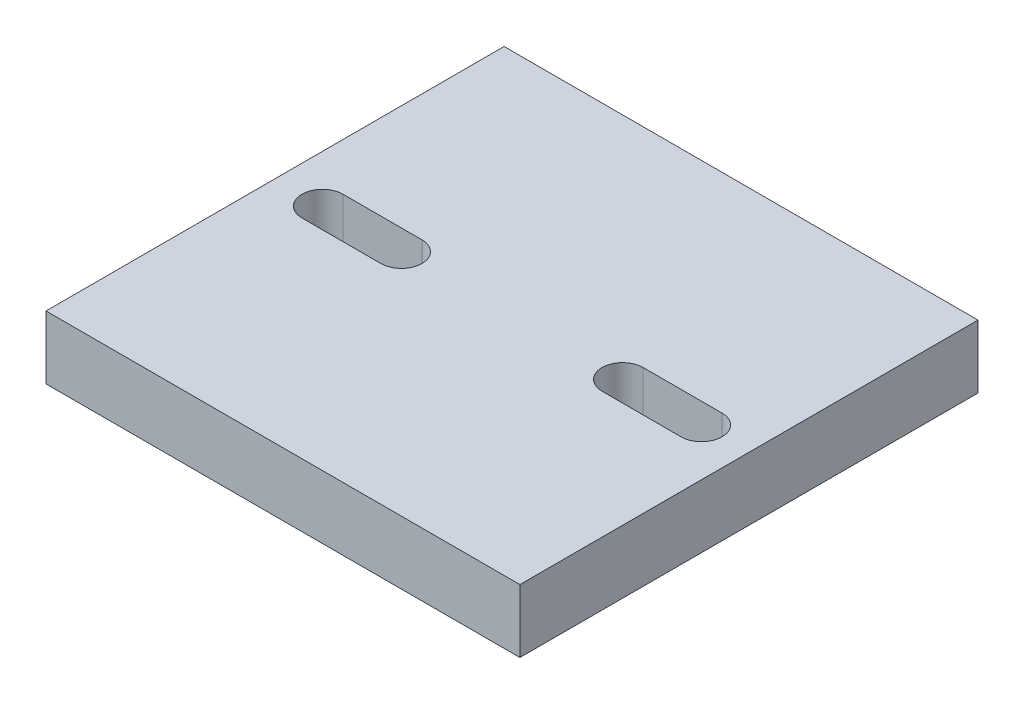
ISO-10303-21;
HEADER;
FILE_DESCRIPTION(('STEP AP214'),'2;1');
FILE_NAME('part.step','',(''),(''),'','','');
FILE_SCHEMA(('AUTOMOTIVE_DESIGN { 1 0 10303 214 1 1 1 1 }'));
ENDSEC;
DATA;
#1=APPLICATION_CONTEXT('core data for automotive mechanical design processes');
#2=APPLICATION_PROTOCOL_DEFINITION('international standard','automotive_design',2000,#1);
#3=PRODUCT_CONTEXT('',#1,'mechanical');
#4=PRODUCT('Part','Part','',(#3));
#5=PRODUCT_RELATED_PRODUCT_CATEGORY('part','',(#4));
#6=PRODUCT_DEFINITION_FORMATION('','',#4);
#7=PRODUCT_DEFINITION_CONTEXT('part definition',#1,'design');
#8=PRODUCT_DEFINITION('design','',#6,#7);
#9=PRODUCT_DEFINITION_SHAPE('','',#8);
#10=(LENGTH_UNIT() NAMED_UNIT(*) SI_UNIT(.MILLI.,.METRE.));
#11=(NAMED_UNIT(*) PLANE_ANGLE_UNIT() SI_UNIT($,.RADIAN.));
#12=(NAMED_UNIT(*) SI_UNIT($,.STERADIAN.) SOLID_ANGLE_UNIT());
#13=UNCERTAINTY_MEASURE_WITH_UNIT(LENGTH_MEASURE(1.E-05),#10,'distance_accuracy_value','');
#14=(GEOMETRIC_REPRESENTATION_CONTEXT(3) GLOBAL_UNCERTAINTY_ASSIGNED_CONTEXT((#13)) GLOBAL_UNIT_ASSIGNED_CONTEXT((#10,
#11,#12)) REPRESENTATION_CONTEXT('',''));
#15=CARTESIAN_POINT('',(0.,0.,0.));
#16=DIRECTION('',(0.,0.,1.));
#17=DIRECTION('',(1.,0.,0.));
#18=AXIS2_PLACEMENT_3D('',#15,#16,#17);
#19=CARTESIAN_POINT('',(-60.,0.,58.));
#20=DIRECTION('',(1.,0.,0.));
#21=DIRECTION('',(0.,0.,-1.));
#22=AXIS2_PLACEMENT_3D('',#19,#20,#21);
#23=PLANE('',#22);
#24=DIRECTION('',(0.,-1.,0.));
#25=VECTOR('',#24,1.);
#26=CARTESIAN_POINT('',(-60.,0.,0.));
#27=LINE('',#26,#25);
#28=CARTESIAN_POINT('',(-60.,8.,0.));
#29=VERTEX_POINT('',#28);
#30=CARTESIAN_POINT('',(-60.,0.,0.));
#31=VERTEX_POINT('',#30);
#32=EDGE_CURVE('E185',#29,#31,#27,.T.);
#33=ORIENTED_EDGE('',*,*,#32,.T.);
#34=DIRECTION('',(0.,0.,-1.));
#35=VECTOR('',#34,1.);
#36=CARTESIAN_POINT('',(-60.,0.,58.));
#37=LINE('',#36,#35);
#38=CARTESIAN_POINT('',(-60.,0.,58.));
#39=VERTEX_POINT('',#38);
#40=EDGE_CURVE('E11',#39,#31,#37,.T.);
#41=ORIENTED_EDGE('',*,*,#40,.F.);
#42=DIRECTION('',(0.,-1.,0.));
#43=VECTOR('',#42,1.);
#44=CARTESIAN_POINT('',(-60.,0.,58.));
#45=LINE('',#44,#43);
#46=CARTESIAN_POINT('',(-60.,8.,58.));
#47=VERTEX_POINT('',#46);
#48=EDGE_CURVE('E192',#47,#39,#45,.T.);
#49=ORIENTED_EDGE('',*,*,#48,.F.);
#50=DIRECTION('',(0.,0.,-1.));
#51=VECTOR('',#50,1.);
#52=CARTESIAN_POINT('',(-60.,8.,58.));
#53=LINE('',#52,#51);
#54=EDGE_CURVE('E202',#47,#29,#53,.T.);
#55=ORIENTED_EDGE('',*,*,#54,.T.);
#56=EDGE_LOOP('',(#33,#41,#49,#55));
#57=FACE_BOUND('',#56,.T.);
#58=ADVANCED_FACE('F35',(#57),#23,.F.);
#59=CARTESIAN_POINT('',(-60.,0.,58.));
#60=DIRECTION('',(0.,1.,0.));
#61=DIRECTION('',(0.,0.,1.));
#62=AXIS2_PLACEMENT_3D('',#59,#60,#61);
#63=PLANE('',#62);
#64=DIRECTION('',(-1.,0.,0.));
#65=VECTOR('',#64,1.);
#66=CARTESIAN_POINT('',(-6.,0.,26.4));
#67=LINE('',#66,#65);
#68=CARTESIAN_POINT('',(-6.,0.,26.4));
#69=VERTEX_POINT('',#68);
#70=CARTESIAN_POINT('',(-16.,0.,26.4));
#71=VERTEX_POINT('',#70);
#72=EDGE_CURVE('E131',#69,#71,#67,.T.);
#73=ORIENTED_EDGE('',*,*,#72,.T.);
#74=CARTESIAN_POINT('',(-16.,0.,29.));
#75=DIRECTION('',(0.,1.,0.));
#76=DIRECTION('',(0.,0.,1.));
#77=AXIS2_PLACEMENT_3D('',#74,#75,#76);
#78=CIRCLE('',#77,2.59999999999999);
#79=CARTESIAN_POINT('',(-16.,0.,31.6));
#80=VERTEX_POINT('',#79);
#81=EDGE_CURVE('E125',#71,#80,#78,.T.);
#82=ORIENTED_EDGE('',*,*,#81,.T.);
#83=DIRECTION('',(1.,0.,0.));
#84=VECTOR('',#83,1.);
#85=CARTESIAN_POINT('',(-6.,0.,31.6));
#86=LINE('',#85,#84);
#87=CARTESIAN_POINT('',(-6.,0.,31.6));
#88=VERTEX_POINT('',#87);
#89=EDGE_CURVE('E134',#80,#88,#86,.T.);
#90=ORIENTED_EDGE('',*,*,#89,.T.);
#91=CARTESIAN_POINT('',(-6.,0.,29.));
#92=DIRECTION('',(0.,1.,0.));
#93=DIRECTION('',(0.,0.,-1.));
#94=AXIS2_PLACEMENT_3D('',#91,#92,#93);
#95=CIRCLE('',#94,2.59999999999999);
#96=EDGE_CURVE('E49',#88,#69,#95,.T.);
#97=ORIENTED_EDGE('',*,*,#96,.T.);
#98=EDGE_LOOP('',(#73,#82,#90,#97));
#99=FACE_BOUND('',#98,.T.);
#100=DIRECTION('',(-1.,0.,0.));
#101=VECTOR('',#100,1.);
#102=CARTESIAN_POINT('',(-54.,0.,26.4));
#103=LINE('',#102,#101);
#104=CARTESIAN_POINT('',(-44.,0.,26.4));
#105=VERTEX_POINT('',#104);
#106=CARTESIAN_POINT('',(-54.,0.,26.4));
#107=VERTEX_POINT('',#106);
#108=EDGE_CURVE('E170',#105,#107,#103,.T.);
#109=ORIENTED_EDGE('',*,*,#108,.T.);
#110=CARTESIAN_POINT('',(-54.,0.,29.));
#111=DIRECTION('',(0.,1.,0.));
#112=DIRECTION('',(0.,0.,1.));
#113=AXIS2_PLACEMENT_3D('',#110,#111,#112);
#114=CIRCLE('',#113,2.59999999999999);
#115=CARTESIAN_POINT('',(-54.,0.,31.6));
#116=VERTEX_POINT('',#115);
#117=EDGE_CURVE('E160',#107,#116,#114,.T.);
#118=ORIENTED_EDGE('',*,*,#117,.T.);
#119=DIRECTION('',(1.,0.,0.));
#120=VECTOR('',#119,1.);
#121=CARTESIAN_POINT('',(-54.,0.,31.6));
#122=LINE('',#121,#120);
#123=CARTESIAN_POINT('',(-44.,0.,31.6));
#124=VERTEX_POINT('',#123);
#125=EDGE_CURVE('E163',#116,#124,#122,.T.);
#126=ORIENTED_EDGE('',*,*,#125,.T.);
#127=CARTESIAN_POINT('',(-44.,0.,29.));
#128=DIRECTION('',(0.,1.,0.));
#129=DIRECTION('',(0.,0.,-1.));
#130=AXIS2_PLACEMENT_3D('',#127,#128,#129);
#131=CIRCLE('',#130,2.59999999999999);
#132=EDGE_CURVE('E167',#124,#105,#131,.T.);
#133=ORIENTED_EDGE('',*,*,#132,.T.);
#134=EDGE_LOOP('',(#109,#118,#126,#133));
#135=FACE_BOUND('',#134,.T.);
#136=DIRECTION('',(1.,0.,0.));
#137=VECTOR('',#136,1.);
#138=CARTESIAN_POINT('',(-60.,0.,0.));
#139=LINE('',#138,#137);
#140=CARTESIAN_POINT('',(0.,0.,0.));
#141=VERTEX_POINT('',#140);
#142=EDGE_CURVE('E205',#31,#141,#139,.T.);
#143=ORIENTED_EDGE('',*,*,#142,.T.);
#144=DIRECTION('',(0.,0.,-1.));
#145=VECTOR('',#144,1.);
#146=CARTESIAN_POINT('',(0.,0.,58.));
#147=LINE('',#146,#145);
#148=CARTESIAN_POINT('',(0.,0.,58.));
#149=VERTEX_POINT('',#148);
#150=EDGE_CURVE('E42',#149,#141,#147,.T.);
#151=ORIENTED_EDGE('',*,*,#150,.F.);
#152=DIRECTION('',(1.,0.,0.));
#153=VECTOR('',#152,1.);
#154=CARTESIAN_POINT('',(-60.,0.,58.));
#155=LINE('',#154,#153);
#156=EDGE_CURVE('E195',#39,#149,#155,.T.);
#157=ORIENTED_EDGE('',*,*,#156,.F.);
#158=ORIENTED_EDGE('',*,*,#40,.T.);
#159=EDGE_LOOP('',(#143,#151,#157,#158));
#160=FACE_BOUND('',#159,.T.);
#161=ADVANCED_FACE('F138',(#99,#135,#160),#63,.F.);
#162=CARTESIAN_POINT('',(0.,0.,58.));
#163=DIRECTION('',(-1.,0.,0.));
#164=DIRECTION('',(0.,0.,1.));
#165=AXIS2_PLACEMENT_3D('',#162,#163,#164);
#166=PLANE('',#165);
#167=DIRECTION('',(0.,1.,0.));
#168=VECTOR('',#167,1.);
#169=CARTESIAN_POINT('',(0.,0.,0.));
#170=LINE('',#169,#168);
#171=CARTESIAN_POINT('',(0.,8.,0.));
#172=VERTEX_POINT('',#171);
#173=EDGE_CURVE('E207',#141,#172,#170,.T.);
#174=ORIENTED_EDGE('',*,*,#173,.T.);
#175=DIRECTION('',(0.,0.,-1.));
#176=VECTOR('',#175,1.);
#177=CARTESIAN_POINT('',(0.,8.,58.));
#178=LINE('',#177,#176);
#179=CARTESIAN_POINT('',(0.,8.,58.));
#180=VERTEX_POINT('',#179);
#181=EDGE_CURVE('E212',#180,#172,#178,.T.);
#182=ORIENTED_EDGE('',*,*,#181,.F.);
#183=DIRECTION('',(0.,1.,0.));
#184=VECTOR('',#183,1.);
#185=CARTESIAN_POINT('',(0.,0.,58.));
#186=LINE('',#185,#184);
#187=EDGE_CURVE('E198',#149,#180,#186,.T.);
#188=ORIENTED_EDGE('',*,*,#187,.F.);
#189=ORIENTED_EDGE('',*,*,#150,.T.);
#190=EDGE_LOOP('',(#174,#182,#188,#189));
#191=FACE_BOUND('',#190,.T.);
#192=ADVANCED_FACE('F219',(#191),#166,.F.);
#193=CARTESIAN_POINT('',(-60.,8.,58.));
#194=DIRECTION('',(0.,-1.,0.));
#195=DIRECTION('',(0.,0.,-1.));
#196=AXIS2_PLACEMENT_3D('',#193,#194,#195);
#197=PLANE('',#196);
#198=DIRECTION('',(1.,0.,0.));
#199=VECTOR('',#198,1.);
#200=CARTESIAN_POINT('',(-6.,8.,31.6));
#201=LINE('',#200,#199);
#202=CARTESIAN_POINT('',(-16.,8.,31.6));
#203=VERTEX_POINT('',#202);
#204=CARTESIAN_POINT('',(-6.,8.,31.6));
#205=VERTEX_POINT('',#204);
#206=EDGE_CURVE('E150',#203,#205,#201,.T.);
#207=ORIENTED_EDGE('',*,*,#206,.F.);
#208=CARTESIAN_POINT('',(-16.,8.,29.));
#209=DIRECTION('',(0.,1.,0.));
#210=DIRECTION('',(0.,0.,1.));
#211=AXIS2_PLACEMENT_3D('',#208,#209,#210);
#212=CIRCLE('',#211,2.59999999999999);
#213=CARTESIAN_POINT('',(-16.,8.,26.4));
#214=VERTEX_POINT('',#213);
#215=EDGE_CURVE('E57',#214,#203,#212,.T.);
#216=ORIENTED_EDGE('',*,*,#215,.F.);
#217=DIRECTION('',(-1.,0.,0.));
#218=VECTOR('',#217,1.);
#219=CARTESIAN_POINT('',(-6.,8.,26.4));
#220=LINE('',#219,#218);
#221=CARTESIAN_POINT('',(-6.,8.,26.4));
#222=VERTEX_POINT('',#221);
#223=EDGE_CURVE('E141',#222,#214,#220,.T.);
#224=ORIENTED_EDGE('',*,*,#223,.F.);
#225=CARTESIAN_POINT('',(-6.,8.,29.));
#226=DIRECTION('',(0.,1.,0.));
#227=DIRECTION('',(0.,0.,-1.));
#228=AXIS2_PLACEMENT_3D('',#225,#226,#227);
#229=CIRCLE('',#228,2.59999999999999);
#230=EDGE_CURVE('E144',#205,#222,#229,.T.);
#231=ORIENTED_EDGE('',*,*,#230,.F.);
#232=EDGE_LOOP('',(#207,#216,#224,#231));
#233=FACE_BOUND('',#232,.T.);
#234=DIRECTION('',(1.,0.,0.));
#235=VECTOR('',#234,1.);
#236=CARTESIAN_POINT('',(-54.,8.,31.6));
#237=LINE('',#236,#235);
#238=CARTESIAN_POINT('',(-54.,8.,31.6));
#239=VERTEX_POINT('',#238);
#240=CARTESIAN_POINT('',(-44.,8.,31.6));
#241=VERTEX_POINT('',#240);
#242=EDGE_CURVE('E175',#239,#241,#237,.T.);
#243=ORIENTED_EDGE('',*,*,#242,.F.);
#244=CARTESIAN_POINT('',(-54.,8.,29.));
#245=DIRECTION('',(0.,1.,0.));
#246=DIRECTION('',(0.,0.,1.));
#247=AXIS2_PLACEMENT_3D('',#244,#245,#246);
#248=CIRCLE('',#247,2.59999999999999);
#249=CARTESIAN_POINT('',(-54.,8.,26.4));
#250=VERTEX_POINT('',#249);
#251=EDGE_CURVE('E156',#250,#239,#248,.T.);
#252=ORIENTED_EDGE('',*,*,#251,.F.);
#253=DIRECTION('',(-1.,0.,0.));
#254=VECTOR('',#253,1.);
#255=CARTESIAN_POINT('',(-54.,8.,26.4));
#256=LINE('',#255,#254);
#257=CARTESIAN_POINT('',(-44.,8.,26.4));
#258=VERTEX_POINT('',#257);
#259=EDGE_CURVE('E164',#258,#250,#256,.T.);
#260=ORIENTED_EDGE('',*,*,#259,.F.);
#261=CARTESIAN_POINT('',(-44.,8.,29.));
#262=DIRECTION('',(0.,1.,0.));
#263=DIRECTION('',(0.,0.,-1.));
#264=AXIS2_PLACEMENT_3D('',#261,#262,#263);
#265=CIRCLE('',#264,2.59999999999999);
#266=EDGE_CURVE('E178',#241,#258,#265,.T.);
#267=ORIENTED_EDGE('',*,*,#266,.F.);
#268=EDGE_LOOP('',(#243,#252,#260,#267));
#269=FACE_BOUND('',#268,.T.);
#270=DIRECTION('',(-1.,0.,0.));
#271=VECTOR('',#270,1.);
#272=CARTESIAN_POINT('',(-60.,8.,0.));
#273=LINE('',#272,#271);
#274=EDGE_CURVE('E196',#172,#29,#273,.T.);
#275=ORIENTED_EDGE('',*,*,#274,.T.);
#276=ORIENTED_EDGE('',*,*,#54,.F.);
#277=DIRECTION('',(-1.,0.,0.));
#278=VECTOR('',#277,1.);
#279=CARTESIAN_POINT('',(-60.,8.,58.));
#280=LINE('',#279,#278);
#281=EDGE_CURVE('E200',#180,#47,#280,.T.);
#282=ORIENTED_EDGE('',*,*,#281,.F.);
#283=ORIENTED_EDGE('',*,*,#181,.T.);
#284=EDGE_LOOP('',(#275,#276,#282,#283));
#285=FACE_BOUND('',#284,.T.);
#286=ADVANCED_FACE('F228',(#233,#269,#285),#197,.F.);
#287=CARTESIAN_POINT('',(0.,0.,58.));
#288=DIRECTION('',(0.,0.,-1.));
#289=DIRECTION('',(-1.,0.,0.));
#290=AXIS2_PLACEMENT_3D('',#287,#288,#289);
#291=PLANE('',#290);
#292=ORIENTED_EDGE('',*,*,#48,.T.);
#293=ORIENTED_EDGE('',*,*,#156,.T.);
#294=ORIENTED_EDGE('',*,*,#187,.T.);
#295=ORIENTED_EDGE('',*,*,#281,.T.);
#296=EDGE_LOOP('',(#292,#293,#294,#295));
#297=FACE_BOUND('',#296,.T.);
#298=ADVANCED_FACE('F234',(#297),#291,.F.);
#299=CARTESIAN_POINT('',(0.,0.,0.));
#300=DIRECTION('',(0.,0.,-1.));
#301=DIRECTION('',(-1.,0.,0.));
#302=AXIS2_PLACEMENT_3D('',#299,#300,#301);
#303=PLANE('',#302);
#304=ORIENTED_EDGE('',*,*,#32,.F.);
#305=ORIENTED_EDGE('',*,*,#274,.F.);
#306=ORIENTED_EDGE('',*,*,#173,.F.);
#307=ORIENTED_EDGE('',*,*,#142,.F.);
#308=EDGE_LOOP('',(#304,#305,#306,#307));
#309=FACE_BOUND('',#308,.T.);
#310=ADVANCED_FACE('F225',(#309),#303,.T.);
#311=CARTESIAN_POINT('',(-54.,0.,29.));
#312=DIRECTION('',(0.,1.,0.));
#313=DIRECTION('',(0.,0.,1.));
#314=AXIS2_PLACEMENT_3D('',#311,#312,#313);
#315=CYLINDRICAL_SURFACE('',#314,2.59999999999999);
#316=ORIENTED_EDGE('',*,*,#251,.T.);
#317=DIRECTION('',(0.,1.,0.));
#318=VECTOR('',#317,1.);
#319=CARTESIAN_POINT('',(-54.,0.,31.6));
#320=LINE('',#319,#318);
#321=EDGE_CURVE('E173',#116,#239,#320,.T.);
#322=ORIENTED_EDGE('',*,*,#321,.F.);
#323=ORIENTED_EDGE('',*,*,#117,.F.);
#324=DIRECTION('',(0.,1.,0.));
#325=VECTOR('',#324,1.);
#326=CARTESIAN_POINT('',(-54.,0.,26.4));
#327=LINE('',#326,#325);
#328=EDGE_CURVE('E183',#107,#250,#327,.T.);
#329=ORIENTED_EDGE('',*,*,#328,.T.);
#330=EDGE_LOOP('',(#316,#322,#323,#329));
#331=FACE_BOUND('',#330,.T.);
#332=ADVANCED_FACE('F247',(#331),#315,.F.);
#333=CARTESIAN_POINT('',(-54.,0.,26.4));
#334=DIRECTION('',(0.,0.,-1.));
#335=DIRECTION('',(-1.,0.,0.));
#336=AXIS2_PLACEMENT_3D('',#333,#334,#335);
#337=PLANE('',#336);
#338=ORIENTED_EDGE('',*,*,#259,.T.);
#339=ORIENTED_EDGE('',*,*,#328,.F.);
#340=ORIENTED_EDGE('',*,*,#108,.F.);
#341=DIRECTION('',(0.,1.,0.));
#342=VECTOR('',#341,1.);
#343=CARTESIAN_POINT('',(-44.,0.,26.4));
#344=LINE('',#343,#342);
#345=EDGE_CURVE('E186',#105,#258,#344,.T.);
#346=ORIENTED_EDGE('',*,*,#345,.T.);
#347=EDGE_LOOP('',(#338,#339,#340,#346));
#348=FACE_BOUND('',#347,.T.);
#349=ADVANCED_FACE('F252',(#348),#337,.F.);
#350=CARTESIAN_POINT('',(-44.,0.,29.));
#351=DIRECTION('',(0.,1.,0.));
#352=DIRECTION('',(0.,0.,1.));
#353=AXIS2_PLACEMENT_3D('',#350,#351,#352);
#354=CYLINDRICAL_SURFACE('',#353,2.59999999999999);
#355=ORIENTED_EDGE('',*,*,#266,.T.);
#356=ORIENTED_EDGE('',*,*,#345,.F.);
#357=ORIENTED_EDGE('',*,*,#132,.F.);
#358=DIRECTION('',(0.,1.,0.));
#359=VECTOR('',#358,1.);
#360=CARTESIAN_POINT('',(-44.,0.,31.6));
#361=LINE('',#360,#359);
#362=EDGE_CURVE('E188',#124,#241,#361,.T.);
#363=ORIENTED_EDGE('',*,*,#362,.T.);
#364=EDGE_LOOP('',(#355,#356,#357,#363));
#365=FACE_BOUND('',#364,.T.);
#366=ADVANCED_FACE('F257',(#365),#354,.F.);
#367=CARTESIAN_POINT('',(-54.,0.,31.6));
#368=DIRECTION('',(0.,0.,1.));
#369=DIRECTION('',(1.,0.,0.));
#370=AXIS2_PLACEMENT_3D('',#367,#368,#369);
#371=PLANE('',#370);
#372=ORIENTED_EDGE('',*,*,#242,.T.);
#373=ORIENTED_EDGE('',*,*,#362,.F.);
#374=ORIENTED_EDGE('',*,*,#125,.F.);
#375=ORIENTED_EDGE('',*,*,#321,.T.);
#376=EDGE_LOOP('',(#372,#373,#374,#375));
#377=FACE_BOUND('',#376,.T.);
#378=ADVANCED_FACE('F254',(#377),#371,.F.);
#379=CARTESIAN_POINT('',(-16.,0.,29.));
#380=DIRECTION('',(0.,1.,0.));
#381=DIRECTION('',(0.,0.,1.));
#382=AXIS2_PLACEMENT_3D('',#379,#380,#381);
#383=CYLINDRICAL_SURFACE('',#382,2.59999999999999);
#384=ORIENTED_EDGE('',*,*,#215,.T.);
#385=DIRECTION('',(0.,1.,0.));
#386=VECTOR('',#385,1.);
#387=CARTESIAN_POINT('',(-16.,0.,31.6));
#388=LINE('',#387,#386);
#389=EDGE_CURVE('E121',#80,#203,#388,.T.);
#390=ORIENTED_EDGE('',*,*,#389,.F.);
#391=ORIENTED_EDGE('',*,*,#81,.F.);
#392=DIRECTION('',(0.,1.,0.));
#393=VECTOR('',#392,1.);
#394=CARTESIAN_POINT('',(-16.,0.,26.4));
#395=LINE('',#394,#393);
#396=EDGE_CURVE('E154',#71,#214,#395,.T.);
#397=ORIENTED_EDGE('',*,*,#396,.T.);
#398=EDGE_LOOP('',(#384,#390,#391,#397));
#399=FACE_BOUND('',#398,.T.);
#400=ADVANCED_FACE('F123',(#399),#383,.F.);
#401=CARTESIAN_POINT('',(-6.,0.,26.4));
#402=DIRECTION('',(0.,0.,-1.));
#403=DIRECTION('',(-1.,0.,0.));
#404=AXIS2_PLACEMENT_3D('',#401,#402,#403);
#405=PLANE('',#404);
#406=ORIENTED_EDGE('',*,*,#223,.T.);
#407=ORIENTED_EDGE('',*,*,#396,.F.);
#408=ORIENTED_EDGE('',*,*,#72,.F.);
#409=DIRECTION('',(0.,1.,0.));
#410=VECTOR('',#409,1.);
#411=CARTESIAN_POINT('',(-6.,0.,26.4));
#412=LINE('',#411,#410);
#413=EDGE_CURVE('E157',#69,#222,#412,.T.);
#414=ORIENTED_EDGE('',*,*,#413,.T.);
#415=EDGE_LOOP('',(#406,#407,#408,#414));
#416=FACE_BOUND('',#415,.T.);
#417=ADVANCED_FACE('F267',(#416),#405,.F.);
#418=CARTESIAN_POINT('',(-6.,0.,29.));
#419=DIRECTION('',(0.,1.,0.));
#420=DIRECTION('',(0.,0.,1.));
#421=AXIS2_PLACEMENT_3D('',#418,#419,#420);
#422=CYLINDRICAL_SURFACE('',#421,2.59999999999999);
#423=ORIENTED_EDGE('',*,*,#230,.T.);
#424=ORIENTED_EDGE('',*,*,#413,.F.);
#425=ORIENTED_EDGE('',*,*,#96,.F.);
#426=DIRECTION('',(0.,1.,0.));
#427=VECTOR('',#426,1.);
#428=CARTESIAN_POINT('',(-6.,0.,31.6));
#429=LINE('',#428,#427);
#430=EDGE_CURVE('E130',#88,#205,#429,.T.);
#431=ORIENTED_EDGE('',*,*,#430,.T.);
#432=EDGE_LOOP('',(#423,#424,#425,#431));
#433=FACE_BOUND('',#432,.T.);
#434=ADVANCED_FACE('F270',(#433),#422,.F.);
#435=CARTESIAN_POINT('',(-6.,0.,31.6));
#436=DIRECTION('',(0.,0.,1.));
#437=DIRECTION('',(1.,0.,0.));
#438=AXIS2_PLACEMENT_3D('',#435,#436,#437);
#439=PLANE('',#438);
#440=ORIENTED_EDGE('',*,*,#206,.T.);
#441=ORIENTED_EDGE('',*,*,#430,.F.);
#442=ORIENTED_EDGE('',*,*,#89,.F.);
#443=ORIENTED_EDGE('',*,*,#389,.T.);
#444=EDGE_LOOP('',(#440,#441,#442,#443));
#445=FACE_BOUND('',#444,.T.);
#446=ADVANCED_FACE('F135',(#445),#439,.F.);
#447=CLOSED_SHELL('',(#58,#161,#192,#286,#298,#310,#332,#349,#366,#378,#400,#417,#434,#446));
#448=MANIFOLD_SOLID_BREP('B2',#447);
#449=ADVANCED_BREP_SHAPE_REPRESENTATION('',(#18,#448),#14);
#450=SHAPE_DEFINITION_REPRESENTATION(#9,#449);
ENDSEC;
END-ISO-10303-21;
